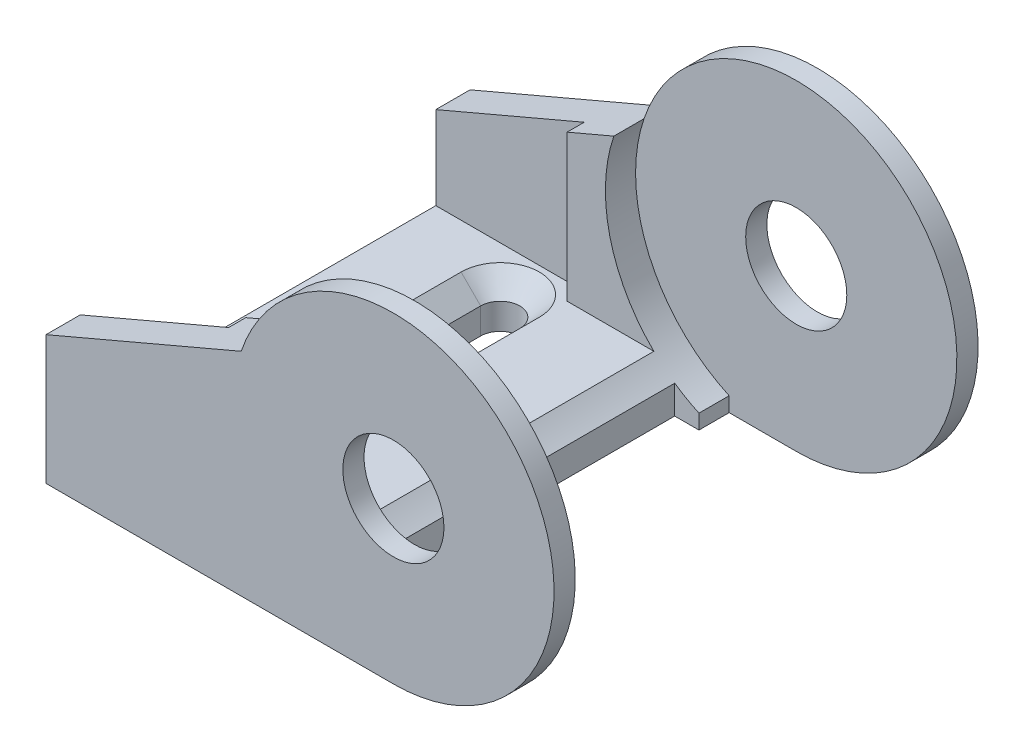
ISO-10303-21;
HEADER;
FILE_DESCRIPTION(('STEP AP214'),'2;1');
FILE_NAME('part.step','',(''),(''),'','','');
FILE_SCHEMA(('AUTOMOTIVE_DESIGN { 1 0 10303 214 1 1 1 1 }'));
ENDSEC;
DATA;
#1=APPLICATION_CONTEXT('core data for automotive mechanical design processes');
#2=APPLICATION_PROTOCOL_DEFINITION('international standard','automotive_design',2000,#1);
#3=PRODUCT_CONTEXT('',#1,'mechanical');
#4=PRODUCT('Part','Part','',(#3));
#5=PRODUCT_RELATED_PRODUCT_CATEGORY('part','',(#4));
#6=PRODUCT_DEFINITION_FORMATION('','',#4);
#7=PRODUCT_DEFINITION_CONTEXT('part definition',#1,'design');
#8=PRODUCT_DEFINITION('design','',#6,#7);
#9=PRODUCT_DEFINITION_SHAPE('','',#8);
#10=(LENGTH_UNIT() NAMED_UNIT(*) SI_UNIT(.MILLI.,.METRE.));
#11=(NAMED_UNIT(*) PLANE_ANGLE_UNIT() SI_UNIT($,.RADIAN.));
#12=(NAMED_UNIT(*) SI_UNIT($,.STERADIAN.) SOLID_ANGLE_UNIT());
#13=UNCERTAINTY_MEASURE_WITH_UNIT(LENGTH_MEASURE(1.E-05),#10,'distance_accuracy_value','');
#14=(GEOMETRIC_REPRESENTATION_CONTEXT(3) GLOBAL_UNCERTAINTY_ASSIGNED_CONTEXT((#13)) GLOBAL_UNIT_ASSIGNED_CONTEXT((#10,
#11,#12)) REPRESENTATION_CONTEXT('',''));
#15=CARTESIAN_POINT('',(0.,0.,0.));
#16=DIRECTION('',(0.,0.,1.));
#17=DIRECTION('',(1.,0.,0.));
#18=AXIS2_PLACEMENT_3D('',#15,#16,#17);
#19=CARTESIAN_POINT('',(-107.188,-17.907,65.4898962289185));
#20=DIRECTION('',(0.,1.,0.));
#21=DIRECTION('',(0.,0.,1.));
#22=AXIS2_PLACEMENT_3D('',#19,#20,#21);
#23=PLANE('',#22);
#24=DIRECTION('',(0.,0.,-1.));
#25=VECTOR('',#24,1.);
#26=CARTESIAN_POINT('',(-107.188,-17.907,20.701));
#27=LINE('',#26,#25);
#28=CARTESIAN_POINT('',(-107.188,-17.907,20.701));
#29=VERTEX_POINT('',#28);
#30=CARTESIAN_POINT('',(-107.188,-17.907,9.27100000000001));
#31=VERTEX_POINT('',#30);
#32=EDGE_CURVE('E373',#29,#31,#27,.T.);
#33=ORIENTED_EDGE('',*,*,#32,.F.);
#34=CARTESIAN_POINT('',(-113.284,-17.907,20.701));
#35=DIRECTION('',(0.,-1.,0.));
#36=DIRECTION('',(0.,0.,1.));
#37=AXIS2_PLACEMENT_3D('',#34,#35,#36);
#38=CIRCLE('',#37,6.09600000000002);
#39=CARTESIAN_POINT('',(-119.38,-17.907,20.701));
#40=VERTEX_POINT('',#39);
#41=EDGE_CURVE('E382',#40,#29,#38,.F.);
#42=ORIENTED_EDGE('',*,*,#41,.F.);
#43=DIRECTION('',(0.,0.,1.));
#44=VECTOR('',#43,1.);
#45=CARTESIAN_POINT('',(-119.38,-17.907,9.27100000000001));
#46=LINE('',#45,#44);
#47=CARTESIAN_POINT('',(-119.38,-17.907,9.27100000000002));
#48=VERTEX_POINT('',#47);
#49=EDGE_CURVE('E387',#48,#40,#46,.T.);
#50=ORIENTED_EDGE('',*,*,#49,.F.);
#51=CARTESIAN_POINT('',(-113.284,-17.907,9.271));
#52=DIRECTION('',(0.,-1.,0.));
#53=DIRECTION('',(0.,0.,1.));
#54=AXIS2_PLACEMENT_3D('',#51,#52,#53);
#55=CIRCLE('',#54,6.09600000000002);
#56=EDGE_CURVE('E391',#31,#48,#55,.F.);
#57=ORIENTED_EDGE('',*,*,#56,.F.);
#58=EDGE_LOOP('',(#33,#42,#50,#57));
#59=FACE_BOUND('',#58,.T.);
#60=DIRECTION('',(0.,0.,-1.));
#61=VECTOR('',#60,1.);
#62=CARTESIAN_POINT('',(-107.188,-17.907,-20.701));
#63=LINE('',#62,#61);
#64=CARTESIAN_POINT('',(-107.188,-17.907,-20.701));
#65=VERTEX_POINT('',#64);
#66=CARTESIAN_POINT('',(-107.188,-17.907,-9.27100000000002));
#67=VERTEX_POINT('',#66);
#68=EDGE_CURVE('E333',#65,#67,#63,.F.);
#69=ORIENTED_EDGE('',*,*,#68,.T.);
#70=CARTESIAN_POINT('',(-113.284,-17.907,-9.271));
#71=DIRECTION('',(0.,-1.,0.));
#72=DIRECTION('',(0.,0.,1.));
#73=AXIS2_PLACEMENT_3D('',#70,#71,#72);
#74=CIRCLE('',#73,6.09600000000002);
#75=CARTESIAN_POINT('',(-119.38,-17.907,-9.27100000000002));
#76=VERTEX_POINT('',#75);
#77=EDGE_CURVE('E329',#67,#76,#74,.T.);
#78=ORIENTED_EDGE('',*,*,#77,.T.);
#79=DIRECTION('',(0.,0.,1.));
#80=VECTOR('',#79,1.);
#81=CARTESIAN_POINT('',(-119.38,-17.907,-9.27100000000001));
#82=LINE('',#81,#80);
#83=CARTESIAN_POINT('',(-119.38,-17.907,-20.701));
#84=VERTEX_POINT('',#83);
#85=EDGE_CURVE('E339',#76,#84,#82,.F.);
#86=ORIENTED_EDGE('',*,*,#85,.T.);
#87=CARTESIAN_POINT('',(-113.284,-17.907,-20.701));
#88=DIRECTION('',(0.,-1.,0.));
#89=DIRECTION('',(0.,0.,1.));
#90=AXIS2_PLACEMENT_3D('',#87,#88,#89);
#91=CIRCLE('',#90,6.09600000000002);
#92=EDGE_CURVE('E336',#84,#65,#91,.T.);
#93=ORIENTED_EDGE('',*,*,#92,.T.);
#94=EDGE_LOOP('',(#69,#78,#86,#93));
#95=FACE_BOUND('',#94,.T.);
#96=DIRECTION('',(-1.,0.,0.));
#97=VECTOR('',#96,1.);
#98=CARTESIAN_POINT('',(-90.424,-17.907,25.019));
#99=LINE('',#98,#97);
#100=CARTESIAN_POINT('',(-93.6725416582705,-17.907,25.019));
#101=VERTEX_POINT('',#100);
#102=CARTESIAN_POINT('',(-107.188,-17.907,25.019));
#103=VERTEX_POINT('',#102);
#104=EDGE_CURVE('E474',#101,#103,#99,.T.);
#105=ORIENTED_EDGE('',*,*,#104,.F.);
#106=DIRECTION('',(0.,0.,-1.));
#107=VECTOR('',#106,1.);
#108=CARTESIAN_POINT('',(-93.6725416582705,-17.907,100.482418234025));
#109=LINE('',#108,#107);
#110=CARTESIAN_POINT('',(-93.6725416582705,-17.907,-25.019));
#111=VERTEX_POINT('',#110);
#112=EDGE_CURVE('E50',#101,#111,#109,.T.);
#113=ORIENTED_EDGE('',*,*,#112,.T.);
#114=DIRECTION('',(-1.,0.,0.));
#115=VECTOR('',#114,1.);
#116=CARTESIAN_POINT('',(-90.424,-17.907,-25.019));
#117=LINE('',#116,#115);
#118=CARTESIAN_POINT('',(-107.188,-17.907,-25.019));
#119=VERTEX_POINT('',#118);
#120=EDGE_CURVE('E464',#111,#119,#117,.T.);
#121=ORIENTED_EDGE('',*,*,#120,.T.);
#122=DIRECTION('',(0.,0.,-1.));
#123=VECTOR('',#122,1.);
#124=CARTESIAN_POINT('',(-107.188,-17.907,65.4898962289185));
#125=LINE('',#124,#123);
#126=CARTESIAN_POINT('',(-107.188,-17.907,-27.686));
#127=VERTEX_POINT('',#126);
#128=EDGE_CURVE('E513',#119,#127,#125,.T.);
#129=ORIENTED_EDGE('',*,*,#128,.T.);
#130=DIRECTION('',(1.,0.,0.));
#131=VECTOR('',#130,1.);
#132=CARTESIAN_POINT('',(-107.188,-17.907,-27.686));
#133=LINE('',#132,#131);
#134=CARTESIAN_POINT('',(-130.302,-17.907,-27.686));
#135=VERTEX_POINT('',#134);
#136=EDGE_CURVE('E486',#135,#127,#133,.T.);
#137=ORIENTED_EDGE('',*,*,#136,.F.);
#138=DIRECTION('',(0.,0.,-1.));
#139=VECTOR('',#138,1.);
#140=CARTESIAN_POINT('',(-130.302,-17.907,65.4898962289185));
#141=LINE('',#140,#139);
#142=CARTESIAN_POINT('',(-130.302,-17.907,27.686));
#143=VERTEX_POINT('',#142);
#144=EDGE_CURVE('E509',#143,#135,#141,.T.);
#145=ORIENTED_EDGE('',*,*,#144,.F.);
#146=DIRECTION('',(-1.,0.,0.));
#147=VECTOR('',#146,1.);
#148=CARTESIAN_POINT('',(-107.188,-17.907,27.686));
#149=LINE('',#148,#147);
#150=CARTESIAN_POINT('',(-107.188,-17.907,27.686));
#151=VERTEX_POINT('',#150);
#152=EDGE_CURVE('E497',#151,#143,#149,.T.);
#153=ORIENTED_EDGE('',*,*,#152,.F.);
#154=EDGE_CURVE('E514',#151,#103,#125,.T.);
#155=ORIENTED_EDGE('',*,*,#154,.T.);
#156=EDGE_LOOP('',(#105,#113,#121,#129,#137,#145,#153,#155));
#157=FACE_BOUND('',#156,.T.);
#158=ADVANCED_FACE('F34',(#59,#95,#157),#23,.T.);
#159=CARTESIAN_POINT('',(-76.2,-25.019,33.02));
#160=DIRECTION('',(0.,1.,0.));
#161=DIRECTION('',(0.,0.,1.));
#162=AXIS2_PLACEMENT_3D('',#159,#160,#161);
#163=PLANE('',#162);
#164=DIRECTION('',(0.,0.,-1.));
#165=VECTOR('',#164,1.);
#166=CARTESIAN_POINT('',(-110.236,-25.019,20.701));
#167=LINE('',#166,#165);
#168=CARTESIAN_POINT('',(-110.236,-25.019,20.701));
#169=VERTEX_POINT('',#168);
#170=CARTESIAN_POINT('',(-110.236,-25.019,9.27100000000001));
#171=VERTEX_POINT('',#170);
#172=EDGE_CURVE('E415',#169,#171,#167,.T.);
#173=ORIENTED_EDGE('',*,*,#172,.T.);
#174=CARTESIAN_POINT('',(-113.284,-25.019,9.271));
#175=DIRECTION('',(0.,1.,0.));
#176=DIRECTION('',(0.,0.,-1.));
#177=AXIS2_PLACEMENT_3D('',#174,#175,#176);
#178=CIRCLE('',#177,3.04800000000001);
#179=CARTESIAN_POINT('',(-116.332,-25.019,9.27100000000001));
#180=VERTEX_POINT('',#179);
#181=EDGE_CURVE('E418',#171,#180,#178,.T.);
#182=ORIENTED_EDGE('',*,*,#181,.T.);
#183=DIRECTION('',(0.,0.,1.));
#184=VECTOR('',#183,1.);
#185=CARTESIAN_POINT('',(-116.332,-25.019,20.701));
#186=LINE('',#185,#184);
#187=CARTESIAN_POINT('',(-116.332,-25.019,20.701));
#188=VERTEX_POINT('',#187);
#189=EDGE_CURVE('E403',#180,#188,#186,.T.);
#190=ORIENTED_EDGE('',*,*,#189,.T.);
#191=CARTESIAN_POINT('',(-113.284,-25.019,20.701));
#192=DIRECTION('',(0.,1.,0.));
#193=DIRECTION('',(0.,0.,-1.));
#194=AXIS2_PLACEMENT_3D('',#191,#192,#193);
#195=CIRCLE('',#194,3.04800000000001);
#196=EDGE_CURVE('E398',#188,#169,#195,.T.);
#197=ORIENTED_EDGE('',*,*,#196,.T.);
#198=EDGE_LOOP('',(#173,#182,#190,#197));
#199=FACE_BOUND('',#198,.T.);
#200=CARTESIAN_POINT('',(-113.284,-25.019,-20.701));
#201=DIRECTION('',(0.,-1.,0.));
#202=DIRECTION('',(0.,0.,1.));
#203=AXIS2_PLACEMENT_3D('',#200,#201,#202);
#204=CIRCLE('',#203,3.04800000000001);
#205=CARTESIAN_POINT('',(-116.332,-25.019,-20.701));
#206=VERTEX_POINT('',#205);
#207=CARTESIAN_POINT('',(-110.236,-25.019,-20.701));
#208=VERTEX_POINT('',#207);
#209=EDGE_CURVE('E332',#206,#208,#204,.T.);
#210=ORIENTED_EDGE('',*,*,#209,.F.);
#211=DIRECTION('',(0.,0.,-1.));
#212=VECTOR('',#211,1.);
#213=CARTESIAN_POINT('',(-116.332,-25.019,-20.701));
#214=LINE('',#213,#212);
#215=CARTESIAN_POINT('',(-116.332,-25.019,-9.27100000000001));
#216=VERTEX_POINT('',#215);
#217=EDGE_CURVE('E363',#216,#206,#214,.T.);
#218=ORIENTED_EDGE('',*,*,#217,.F.);
#219=CARTESIAN_POINT('',(-113.284,-25.019,-9.271));
#220=DIRECTION('',(0.,-1.,0.));
#221=DIRECTION('',(0.,0.,1.));
#222=AXIS2_PLACEMENT_3D('',#219,#220,#221);
#223=CIRCLE('',#222,3.04800000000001);
#224=CARTESIAN_POINT('',(-110.236,-25.019,-9.27100000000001));
#225=VERTEX_POINT('',#224);
#226=EDGE_CURVE('E366',#225,#216,#223,.T.);
#227=ORIENTED_EDGE('',*,*,#226,.F.);
#228=DIRECTION('',(0.,0.,1.));
#229=VECTOR('',#228,1.);
#230=CARTESIAN_POINT('',(-110.236,-25.019,-20.701));
#231=LINE('',#230,#229);
#232=EDGE_CURVE('E352',#208,#225,#231,.T.);
#233=ORIENTED_EDGE('',*,*,#232,.F.);
#234=EDGE_LOOP('',(#210,#218,#227,#233));
#235=FACE_BOUND('',#234,.T.);
#236=DIRECTION('',(0.,0.,-1.));
#237=VECTOR('',#236,1.);
#238=CARTESIAN_POINT('',(-86.6480176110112,-25.019,100.482418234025));
#239=LINE('',#238,#237);
#240=CARTESIAN_POINT('',(-86.6480176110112,-25.019,29.718));
#241=VERTEX_POINT('',#240);
#242=CARTESIAN_POINT('',(-86.6480176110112,-25.019,25.019));
#243=VERTEX_POINT('',#242);
#244=EDGE_CURVE('E278',#241,#243,#239,.T.);
#245=ORIENTED_EDGE('',*,*,#244,.F.);
#246=DIRECTION('',(1.,0.,0.));
#247=VECTOR('',#246,1.);
#248=CARTESIAN_POINT('',(-86.6480176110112,-25.019,29.718));
#249=LINE('',#248,#247);
#250=CARTESIAN_POINT('',(-76.2,-25.019,29.718));
#251=VERTEX_POINT('',#250);
#252=EDGE_CURVE('E299',#241,#251,#249,.T.);
#253=ORIENTED_EDGE('',*,*,#252,.T.);
#254=DIRECTION('',(0.,0.,-1.));
#255=VECTOR('',#254,1.);
#256=CARTESIAN_POINT('',(-76.2,-25.019,33.02));
#257=LINE('',#256,#255);
#258=CARTESIAN_POINT('',(-76.2,-25.019,33.02));
#259=VERTEX_POINT('',#258);
#260=EDGE_CURVE('E549',#259,#251,#257,.T.);
#261=ORIENTED_EDGE('',*,*,#260,.F.);
#262=DIRECTION('',(-1.,0.,0.));
#263=VECTOR('',#262,1.);
#264=CARTESIAN_POINT('',(-76.2,-25.019,33.02));
#265=LINE('',#264,#263);
#266=CARTESIAN_POINT('',(-130.302,-25.019,33.02));
#267=VERTEX_POINT('',#266);
#268=EDGE_CURVE('E519',#259,#267,#265,.T.);
#269=ORIENTED_EDGE('',*,*,#268,.T.);
#270=DIRECTION('',(0.,0.,-1.));
#271=VECTOR('',#270,1.);
#272=CARTESIAN_POINT('',(-130.302,-25.019,33.02));
#273=LINE('',#272,#271);
#274=CARTESIAN_POINT('',(-130.302,-25.019,27.686));
#275=VERTEX_POINT('',#274);
#276=EDGE_CURVE('E546',#267,#275,#273,.T.);
#277=ORIENTED_EDGE('',*,*,#276,.T.);
#278=DIRECTION('',(1.,0.,0.));
#279=VECTOR('',#278,1.);
#280=CARTESIAN_POINT('',(-120.396,-25.019,27.686));
#281=LINE('',#280,#279);
#282=CARTESIAN_POINT('',(-120.396,-25.019,27.686));
#283=VERTEX_POINT('',#282);
#284=EDGE_CURVE('E435',#275,#283,#281,.T.);
#285=ORIENTED_EDGE('',*,*,#284,.T.);
#286=DIRECTION('',(0.,0.,-1.));
#287=VECTOR('',#286,1.);
#288=CARTESIAN_POINT('',(-120.396,-25.019,-27.686));
#289=LINE('',#288,#287);
#290=CARTESIAN_POINT('',(-120.396,-25.019,-27.686));
#291=VERTEX_POINT('',#290);
#292=EDGE_CURVE('E425',#283,#291,#289,.T.);
#293=ORIENTED_EDGE('',*,*,#292,.T.);
#294=DIRECTION('',(-1.,0.,0.));
#295=VECTOR('',#294,1.);
#296=CARTESIAN_POINT('',(-120.396,-25.019,-27.686));
#297=LINE('',#296,#295);
#298=CARTESIAN_POINT('',(-130.302,-25.019,-27.686));
#299=VERTEX_POINT('',#298);
#300=EDGE_CURVE('E445',#291,#299,#297,.T.);
#301=ORIENTED_EDGE('',*,*,#300,.T.);
#302=CARTESIAN_POINT('',(-130.302,-25.019,-33.02));
#303=VERTEX_POINT('',#302);
#304=EDGE_CURVE('E545',#299,#303,#273,.T.);
#305=ORIENTED_EDGE('',*,*,#304,.T.);
#306=DIRECTION('',(-1.,0.,0.));
#307=VECTOR('',#306,1.);
#308=CARTESIAN_POINT('',(-76.2,-25.019,-33.02));
#309=LINE('',#308,#307);
#310=CARTESIAN_POINT('',(-76.2,-25.019,-33.02));
#311=VERTEX_POINT('',#310);
#312=EDGE_CURVE('E500',#311,#303,#309,.T.);
#313=ORIENTED_EDGE('',*,*,#312,.F.);
#314=CARTESIAN_POINT('',(-76.2,-25.019,-29.718));
#315=VERTEX_POINT('',#314);
#316=EDGE_CURVE('E294',#315,#311,#257,.T.);
#317=ORIENTED_EDGE('',*,*,#316,.F.);
#318=DIRECTION('',(1.,0.,0.));
#319=VECTOR('',#318,1.);
#320=CARTESIAN_POINT('',(-86.6480176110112,-25.019,-29.718));
#321=LINE('',#320,#319);
#322=CARTESIAN_POINT('',(-86.6480176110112,-25.019,-29.718));
#323=VERTEX_POINT('',#322);
#324=EDGE_CURVE('E285',#323,#315,#321,.T.);
#325=ORIENTED_EDGE('',*,*,#324,.F.);
#326=CARTESIAN_POINT('',(-86.6480176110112,-25.019,-25.019));
#327=VERTEX_POINT('',#326);
#328=EDGE_CURVE('E268',#327,#323,#239,.T.);
#329=ORIENTED_EDGE('',*,*,#328,.F.);
#330=DIRECTION('',(-1.,0.,0.));
#331=VECTOR('',#330,1.);
#332=CARTESIAN_POINT('',(-76.2,-25.019,-25.019));
#333=LINE('',#332,#331);
#334=CARTESIAN_POINT('',(-90.424,-25.019,-25.019));
#335=VERTEX_POINT('',#334);
#336=EDGE_CURVE('E458',#327,#335,#333,.T.);
#337=ORIENTED_EDGE('',*,*,#336,.T.);
#338=DIRECTION('',(0.,0.,1.));
#339=VECTOR('',#338,1.);
#340=CARTESIAN_POINT('',(-90.424,-25.019,-25.019));
#341=LINE('',#340,#339);
#342=CARTESIAN_POINT('',(-90.424,-25.019,25.019));
#343=VERTEX_POINT('',#342);
#344=EDGE_CURVE('E469',#335,#343,#341,.T.);
#345=ORIENTED_EDGE('',*,*,#344,.T.);
#346=DIRECTION('',(-1.,0.,0.));
#347=VECTOR('',#346,1.);
#348=CARTESIAN_POINT('',(-76.2,-25.019,25.019));
#349=LINE('',#348,#347);
#350=EDGE_CURVE('E452',#243,#343,#349,.T.);
#351=ORIENTED_EDGE('',*,*,#350,.F.);
#352=EDGE_LOOP('',(#245,#253,#261,#269,#277,#285,#293,#301,#305,#313,#317,#325,#329,#337,#345,#351));
#353=FACE_BOUND('',#352,.T.);
#354=ADVANCED_FACE('F292',(#199,#235,#353),#163,.F.);
#355=CARTESIAN_POINT('',(-90.424,-25.019,-25.019));
#356=DIRECTION('',(-1.,0.,0.));
#357=DIRECTION('',(0.,0.,-1.));
#358=AXIS2_PLACEMENT_3D('',#355,#356,#357);
#359=PLANE('',#358);
#360=DIRECTION('',(0.,0.,-1.));
#361=VECTOR('',#360,1.);
#362=CARTESIAN_POINT('',(-90.424,-20.5822298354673,100.482418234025));
#363=LINE('',#362,#361);
#364=CARTESIAN_POINT('',(-90.424,-20.5822298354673,25.019));
#365=VERTEX_POINT('',#364);
#366=CARTESIAN_POINT('',(-90.424,-20.5822298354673,-25.019));
#367=VERTEX_POINT('',#366);
#368=EDGE_CURVE('E316',#365,#367,#363,.T.);
#369=ORIENTED_EDGE('',*,*,#368,.F.);
#370=DIRECTION('',(0.,1.,0.));
#371=VECTOR('',#370,1.);
#372=CARTESIAN_POINT('',(-90.424,-25.019,25.019));
#373=LINE('',#372,#371);
#374=EDGE_CURVE('E471',#343,#365,#373,.T.);
#375=ORIENTED_EDGE('',*,*,#374,.F.);
#376=ORIENTED_EDGE('',*,*,#344,.F.);
#377=DIRECTION('',(0.,1.,0.));
#378=VECTOR('',#377,1.);
#379=CARTESIAN_POINT('',(-90.424,-25.019,-25.019));
#380=LINE('',#379,#378);
#381=EDGE_CURVE('E460',#335,#367,#380,.T.);
#382=ORIENTED_EDGE('',*,*,#381,.T.);
#383=EDGE_LOOP('',(#369,#375,#376,#382));
#384=FACE_BOUND('',#383,.T.);
#385=ADVANCED_FACE('F563',(#384),#359,.F.);
#386=CARTESIAN_POINT('',(-76.2,0.,-25.019));
#387=DIRECTION('',(0.,0.,1.));
#388=DIRECTION('',(-1.,0.,0.));
#389=AXIS2_PLACEMENT_3D('',#386,#387,#388);
#390=PLANE('',#389);
#391=ORIENTED_EDGE('',*,*,#336,.F.);
#392=DIRECTION('',(0.,1.,0.));
#393=VECTOR('',#392,1.);
#394=CARTESIAN_POINT('',(-86.6480176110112,0.,-25.019));
#395=LINE('',#394,#393);
#396=CARTESIAN_POINT('',(-86.6480176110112,-22.733,-25.019));
#397=VERTEX_POINT('',#396);
#398=EDGE_CURVE('E274',#327,#397,#395,.T.);
#399=ORIENTED_EDGE('',*,*,#398,.T.);
#400=CARTESIAN_POINT('',(-76.2,0.,-25.019));
#401=DIRECTION('',(0.,0.,1.));
#402=DIRECTION('',(1.,0.,0.));
#403=AXIS2_PLACEMENT_3D('',#400,#401,#402);
#404=CIRCLE('',#403,25.019);
#405=EDGE_CURVE('E317',#397,#367,#404,.F.);
#406=ORIENTED_EDGE('',*,*,#405,.T.);
#407=ORIENTED_EDGE('',*,*,#381,.F.);
#408=EDGE_LOOP('',(#391,#399,#406,#407));
#409=FACE_BOUND('',#408,.T.);
#410=ADVANCED_FACE('F569',(#409),#390,.T.);
#411=ORIENTED_EDGE('',*,*,#120,.F.);
#412=CARTESIAN_POINT('',(-99.9051547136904,8.001,-25.019));
#413=VERTEX_POINT('',#412);
#414=EDGE_CURVE('E313',#111,#413,#404,.F.);
#415=ORIENTED_EDGE('',*,*,#414,.T.);
#416=DIRECTION('',(0.919945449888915,0.392046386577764,0.));
#417=VECTOR('',#416,1.);
#418=CARTESIAN_POINT('',(-130.302,-4.953,-25.019));
#419=LINE('',#418,#417);
#420=CARTESIAN_POINT('',(-107.188,4.89732338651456,-25.019));
#421=VERTEX_POINT('',#420);
#422=EDGE_CURVE('E466',#421,#413,#419,.T.);
#423=ORIENTED_EDGE('',*,*,#422,.F.);
#424=DIRECTION('',(0.,-1.,0.));
#425=VECTOR('',#424,1.);
#426=CARTESIAN_POINT('',(-107.188,4.89732338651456,-25.019));
#427=LINE('',#426,#425);
#428=EDGE_CURVE('E483',#421,#119,#427,.T.);
#429=ORIENTED_EDGE('',*,*,#428,.T.);
#430=EDGE_LOOP('',(#411,#415,#423,#429));
#431=FACE_BOUND('',#430,.T.);
#432=ADVANCED_FACE('F582',(#431),#390,.T.);
#433=CARTESIAN_POINT('',(-76.2,0.,25.019));
#434=DIRECTION('',(0.,0.,1.));
#435=DIRECTION('',(-1.,0.,0.));
#436=AXIS2_PLACEMENT_3D('',#433,#434,#435);
#437=PLANE('',#436);
#438=DIRECTION('',(0.,1.,0.));
#439=VECTOR('',#438,1.);
#440=CARTESIAN_POINT('',(-86.6480176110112,0.,25.019));
#441=LINE('',#440,#439);
#442=CARTESIAN_POINT('',(-86.6480176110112,-22.733,25.019));
#443=VERTEX_POINT('',#442);
#444=EDGE_CURVE('E12',#243,#443,#441,.T.);
#445=ORIENTED_EDGE('',*,*,#444,.F.);
#446=ORIENTED_EDGE('',*,*,#350,.T.);
#447=ORIENTED_EDGE('',*,*,#374,.T.);
#448=CARTESIAN_POINT('',(-76.2,0.,25.019));
#449=DIRECTION('',(0.,0.,1.));
#450=DIRECTION('',(1.,0.,0.));
#451=AXIS2_PLACEMENT_3D('',#448,#449,#450);
#452=CIRCLE('',#451,25.019);
#453=EDGE_CURVE('E43',#443,#365,#452,.F.);
#454=ORIENTED_EDGE('',*,*,#453,.F.);
#455=EDGE_LOOP('',(#445,#446,#447,#454));
#456=FACE_BOUND('',#455,.T.);
#457=ADVANCED_FACE('F566',(#456),#437,.F.);
#458=CARTESIAN_POINT('',(-99.9051547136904,8.001,25.019));
#459=VERTEX_POINT('',#458);
#460=EDGE_CURVE('E552',#101,#459,#452,.F.);
#461=ORIENTED_EDGE('',*,*,#460,.F.);
#462=ORIENTED_EDGE('',*,*,#104,.T.);
#463=DIRECTION('',(0.,-1.,0.));
#464=VECTOR('',#463,1.);
#465=CARTESIAN_POINT('',(-107.188,4.89732338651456,25.019));
#466=LINE('',#465,#464);
#467=CARTESIAN_POINT('',(-107.188,4.89732338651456,25.019));
#468=VERTEX_POINT('',#467);
#469=EDGE_CURVE('E480',#468,#103,#466,.T.);
#470=ORIENTED_EDGE('',*,*,#469,.F.);
#471=DIRECTION('',(0.919945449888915,0.392046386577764,0.));
#472=VECTOR('',#471,1.);
#473=CARTESIAN_POINT('',(-130.302,-4.953,25.019));
#474=LINE('',#473,#472);
#475=EDGE_CURVE('E461',#468,#459,#474,.T.);
#476=ORIENTED_EDGE('',*,*,#475,.T.);
#477=EDGE_LOOP('',(#461,#462,#470,#476));
#478=FACE_BOUND('',#477,.T.);
#479=ADVANCED_FACE('F591',(#478),#437,.F.);
#480=CARTESIAN_POINT('',(-76.2,0.,33.02));
#481=DIRECTION('',(0.,0.,-1.));
#482=DIRECTION('',(1.,0.,0.));
#483=AXIS2_PLACEMENT_3D('',#480,#481,#482);
#484=CYLINDRICAL_SURFACE('',#483,25.019);
#485=DIRECTION('',(0.,0.,-1.));
#486=VECTOR('',#485,1.);
#487=CARTESIAN_POINT('',(-99.9051547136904,8.001,33.02));
#488=LINE('',#487,#486);
#489=CARTESIAN_POINT('',(-99.9051547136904,8.001,-29.718));
#490=VERTEX_POINT('',#489);
#491=CARTESIAN_POINT('',(-99.9051547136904,8.001,-33.02));
#492=VERTEX_POINT('',#491);
#493=EDGE_CURVE('E529',#490,#492,#488,.T.);
#494=ORIENTED_EDGE('',*,*,#493,.F.);
#495=CARTESIAN_POINT('',(-76.2,0.,-29.718));
#496=DIRECTION('',(0.,0.,-1.));
#497=DIRECTION('',(-1.,0.,0.));
#498=AXIS2_PLACEMENT_3D('',#495,#496,#497);
#499=CIRCLE('',#498,25.019);
#500=EDGE_CURVE('E296',#315,#490,#499,.F.);
#501=ORIENTED_EDGE('',*,*,#500,.F.);
#502=ORIENTED_EDGE('',*,*,#316,.T.);
#503=CARTESIAN_POINT('',(-76.2,0.,-33.02));
#504=DIRECTION('',(0.,0.,1.));
#505=DIRECTION('',(1.,0.,0.));
#506=AXIS2_PLACEMENT_3D('',#503,#504,#505);
#507=CIRCLE('',#506,25.019);
#508=EDGE_CURVE('E322',#311,#492,#507,.T.);
#509=ORIENTED_EDGE('',*,*,#508,.T.);
#510=EDGE_LOOP('',(#494,#501,#502,#509));
#511=FACE_BOUND('',#510,.T.);
#512=ADVANCED_FACE('F573',(#511),#484,.T.);
#513=ORIENTED_EDGE('',*,*,#260,.T.);
#514=CARTESIAN_POINT('',(-76.2,0.,29.718));
#515=DIRECTION('',(0.,0.,1.));
#516=DIRECTION('',(1.,0.,0.));
#517=AXIS2_PLACEMENT_3D('',#514,#515,#516);
#518=CIRCLE('',#517,25.019);
#519=CARTESIAN_POINT('',(-99.9051547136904,8.001,29.718));
#520=VERTEX_POINT('',#519);
#521=EDGE_CURVE('E305',#251,#520,#518,.T.);
#522=ORIENTED_EDGE('',*,*,#521,.T.);
#523=CARTESIAN_POINT('',(-99.9051547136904,8.001,33.02));
#524=VERTEX_POINT('',#523);
#525=EDGE_CURVE('E537',#524,#520,#488,.T.);
#526=ORIENTED_EDGE('',*,*,#525,.F.);
#527=CARTESIAN_POINT('',(-76.2,0.,33.02));
#528=DIRECTION('',(0.,0.,1.));
#529=DIRECTION('',(1.,0.,0.));
#530=AXIS2_PLACEMENT_3D('',#527,#528,#529);
#531=CIRCLE('',#530,25.019);
#532=EDGE_CURVE('E325',#259,#524,#531,.T.);
#533=ORIENTED_EDGE('',*,*,#532,.F.);
#534=EDGE_LOOP('',(#513,#522,#526,#533));
#535=FACE_BOUND('',#534,.T.);
#536=ADVANCED_FACE('F36',(#535),#484,.T.);
#537=CARTESIAN_POINT('',(-130.302,-4.953,33.02));
#538=DIRECTION('',(0.392046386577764,-0.919945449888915,0.));
#539=DIRECTION('',(-0.919945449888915,-0.392046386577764,0.));
#540=AXIS2_PLACEMENT_3D('',#537,#538,#539);
#541=PLANE('',#540);
#542=ORIENTED_EDGE('',*,*,#422,.T.);
#543=EDGE_CURVE('E541',#413,#490,#488,.T.);
#544=ORIENTED_EDGE('',*,*,#543,.T.);
#545=ORIENTED_EDGE('',*,*,#493,.T.);
#546=DIRECTION('',(0.919945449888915,0.392046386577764,0.));
#547=VECTOR('',#546,1.);
#548=CARTESIAN_POINT('',(-130.302,-4.953,-33.02));
#549=LINE('',#548,#547);
#550=CARTESIAN_POINT('',(-130.302,-4.953,-33.02));
#551=VERTEX_POINT('',#550);
#552=EDGE_CURVE('E523',#551,#492,#549,.T.);
#553=ORIENTED_EDGE('',*,*,#552,.F.);
#554=DIRECTION('',(0.,0.,-1.));
#555=VECTOR('',#554,1.);
#556=CARTESIAN_POINT('',(-130.302,-4.953,33.02));
#557=LINE('',#556,#555);
#558=CARTESIAN_POINT('',(-130.302,-4.953,-27.686));
#559=VERTEX_POINT('',#558);
#560=EDGE_CURVE('E540',#559,#551,#557,.T.);
#561=ORIENTED_EDGE('',*,*,#560,.F.);
#562=DIRECTION('',(-0.919945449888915,-0.392046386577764,0.));
#563=VECTOR('',#562,1.);
#564=CARTESIAN_POINT('',(-130.302,-4.953,-27.686));
#565=LINE('',#564,#563);
#566=CARTESIAN_POINT('',(-107.188,4.89732338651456,-27.686));
#567=VERTEX_POINT('',#566);
#568=EDGE_CURVE('E491',#567,#559,#565,.T.);
#569=ORIENTED_EDGE('',*,*,#568,.F.);
#570=DIRECTION('',(0.,0.,-1.));
#571=VECTOR('',#570,1.);
#572=CARTESIAN_POINT('',(-107.188,4.89732338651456,65.4898962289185));
#573=LINE('',#572,#571);
#574=EDGE_CURVE('E496',#421,#567,#573,.T.);
#575=ORIENTED_EDGE('',*,*,#574,.F.);
#576=EDGE_LOOP('',(#542,#544,#545,#553,#561,#569,#575));
#577=FACE_BOUND('',#576,.T.);
#578=ADVANCED_FACE('F577',(#577),#541,.F.);
#579=CARTESIAN_POINT('',(-107.188,4.89732338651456,65.4898962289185));
#580=DIRECTION('',(-1.,0.,0.));
#581=DIRECTION('',(0.,1.,0.));
#582=AXIS2_PLACEMENT_3D('',#579,#580,#581);
#583=PLANE('',#582);
#584=ORIENTED_EDGE('',*,*,#574,.T.);
#585=DIRECTION('',(0.,1.,0.));
#586=VECTOR('',#585,1.);
#587=CARTESIAN_POINT('',(-107.188,4.89732338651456,-27.686));
#588=LINE('',#587,#586);
#589=EDGE_CURVE('E494',#127,#567,#588,.T.);
#590=ORIENTED_EDGE('',*,*,#589,.F.);
#591=ORIENTED_EDGE('',*,*,#128,.F.);
#592=ORIENTED_EDGE('',*,*,#428,.F.);
#593=EDGE_LOOP('',(#584,#590,#591,#592));
#594=FACE_BOUND('',#593,.T.);
#595=ADVANCED_FACE('F638',(#594),#583,.T.);
#596=CARTESIAN_POINT('',(-130.302,-25.019,33.02));
#597=DIRECTION('',(1.,0.,0.));
#598=DIRECTION('',(0.,0.,1.));
#599=AXIS2_PLACEMENT_3D('',#596,#597,#598);
#600=PLANE('',#599);
#601=ORIENTED_EDGE('',*,*,#276,.F.);
#602=DIRECTION('',(0.,1.,0.));
#603=VECTOR('',#602,1.);
#604=CARTESIAN_POINT('',(-130.302,-25.019,33.02));
#605=LINE('',#604,#603);
#606=CARTESIAN_POINT('',(-130.302,-4.953,33.02));
#607=VERTEX_POINT('',#606);
#608=EDGE_CURVE('E522',#267,#607,#605,.T.);
#609=ORIENTED_EDGE('',*,*,#608,.T.);
#610=CARTESIAN_POINT('',(-130.302,-4.953,27.686));
#611=VERTEX_POINT('',#610);
#612=EDGE_CURVE('E542',#607,#611,#557,.T.);
#613=ORIENTED_EDGE('',*,*,#612,.T.);
#614=DIRECTION('',(0.,1.,0.));
#615=VECTOR('',#614,1.);
#616=CARTESIAN_POINT('',(-130.302,-17.907,27.686));
#617=LINE('',#616,#615);
#618=EDGE_CURVE('E506',#143,#611,#617,.T.);
#619=ORIENTED_EDGE('',*,*,#618,.F.);
#620=ORIENTED_EDGE('',*,*,#144,.T.);
#621=DIRECTION('',(0.,-1.,0.));
#622=VECTOR('',#621,1.);
#623=CARTESIAN_POINT('',(-130.302,-17.907,-27.686));
#624=LINE('',#623,#622);
#625=EDGE_CURVE('E489',#559,#135,#624,.T.);
#626=ORIENTED_EDGE('',*,*,#625,.F.);
#627=ORIENTED_EDGE('',*,*,#560,.T.);
#628=DIRECTION('',(0.,1.,0.));
#629=VECTOR('',#628,1.);
#630=CARTESIAN_POINT('',(-130.302,-25.019,-33.02));
#631=LINE('',#630,#629);
#632=EDGE_CURVE('E532',#303,#551,#631,.T.);
#633=ORIENTED_EDGE('',*,*,#632,.F.);
#634=ORIENTED_EDGE('',*,*,#304,.F.);
#635=DIRECTION('',(0.,-1.,0.));
#636=VECTOR('',#635,1.);
#637=CARTESIAN_POINT('',(-130.302,-22.987,-27.686));
#638=LINE('',#637,#636);
#639=CARTESIAN_POINT('',(-130.302,-22.987,-27.686));
#640=VERTEX_POINT('',#639);
#641=EDGE_CURVE('E455',#640,#299,#638,.T.);
#642=ORIENTED_EDGE('',*,*,#641,.F.);
#643=DIRECTION('',(0.,0.,1.));
#644=VECTOR('',#643,1.);
#645=CARTESIAN_POINT('',(-130.302,-22.987,-27.686));
#646=LINE('',#645,#644);
#647=CARTESIAN_POINT('',(-130.302,-22.987,27.686));
#648=VERTEX_POINT('',#647);
#649=EDGE_CURVE('E437',#640,#648,#646,.T.);
#650=ORIENTED_EDGE('',*,*,#649,.T.);
#651=DIRECTION('',(0.,-1.,0.));
#652=VECTOR('',#651,1.);
#653=CARTESIAN_POINT('',(-130.302,-22.987,27.686));
#654=LINE('',#653,#652);
#655=EDGE_CURVE('E453',#648,#275,#654,.T.);
#656=ORIENTED_EDGE('',*,*,#655,.T.);
#657=EDGE_LOOP('',(#601,#609,#613,#619,#620,#626,#627,#633,#634,#642,#650,#656));
#658=FACE_BOUND('',#657,.T.);
#659=ADVANCED_FACE('F647',(#658),#600,.F.);
#660=CARTESIAN_POINT('',(-107.188,4.89732338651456,27.686));
#661=VERTEX_POINT('',#660);
#662=EDGE_CURVE('E510',#661,#468,#573,.T.);
#663=ORIENTED_EDGE('',*,*,#662,.F.);
#664=DIRECTION('',(0.919945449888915,0.392046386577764,0.));
#665=VECTOR('',#664,1.);
#666=CARTESIAN_POINT('',(-130.302,-4.953,27.686));
#667=LINE('',#666,#665);
#668=EDGE_CURVE('E503',#611,#661,#667,.T.);
#669=ORIENTED_EDGE('',*,*,#668,.F.);
#670=ORIENTED_EDGE('',*,*,#612,.F.);
#671=DIRECTION('',(0.919945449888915,0.392046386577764,0.));
#672=VECTOR('',#671,1.);
#673=CARTESIAN_POINT('',(-130.302,-4.953,33.02));
#674=LINE('',#673,#672);
#675=EDGE_CURVE('E526',#607,#524,#674,.T.);
#676=ORIENTED_EDGE('',*,*,#675,.T.);
#677=ORIENTED_EDGE('',*,*,#525,.T.);
#678=DIRECTION('',(0.,0.,-1.));
#679=VECTOR('',#678,1.);
#680=CARTESIAN_POINT('',(-99.9051547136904,8.00099999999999,100.482418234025));
#681=LINE('',#680,#679);
#682=EDGE_CURVE('E319',#459,#520,#681,.F.);
#683=ORIENTED_EDGE('',*,*,#682,.F.);
#684=ORIENTED_EDGE('',*,*,#475,.F.);
#685=EDGE_LOOP('',(#663,#669,#670,#676,#677,#683,#684));
#686=FACE_BOUND('',#685,.T.);
#687=ADVANCED_FACE('F597',(#686),#541,.F.);
#688=CARTESIAN_POINT('',(-76.2,0.,33.02));
#689=DIRECTION('',(0.,0.,1.));
#690=DIRECTION('',(-1.,0.,0.));
#691=AXIS2_PLACEMENT_3D('',#688,#689,#690);
#692=PLANE('',#691);
#693=CARTESIAN_POINT('',(-76.2,0.,33.02));
#694=DIRECTION('',(0.,0.,1.));
#695=DIRECTION('',(1.,0.,0.));
#696=AXIS2_PLACEMENT_3D('',#693,#694,#695);
#697=CIRCLE('',#696,7.874);
#698=CARTESIAN_POINT('',(-68.326,0.,33.02));
#699=VERTEX_POINT('',#698);
#700=EDGE_CURVE('E1073',#699,#699,#697,.T.);
#701=ORIENTED_EDGE('',*,*,#700,.F.);
#702=EDGE_LOOP('',(#701));
#703=FACE_BOUND('',#702,.T.);
#704=ORIENTED_EDGE('',*,*,#532,.T.);
#705=ORIENTED_EDGE('',*,*,#675,.F.);
#706=ORIENTED_EDGE('',*,*,#608,.F.);
#707=ORIENTED_EDGE('',*,*,#268,.F.);
#708=EDGE_LOOP('',(#704,#705,#706,#707));
#709=FACE_BOUND('',#708,.T.);
#710=ADVANCED_FACE('F637',(#703,#709),#692,.T.);
#711=ORIENTED_EDGE('',*,*,#469,.T.);
#712=ORIENTED_EDGE('',*,*,#154,.F.);
#713=DIRECTION('',(0.,-1.,0.));
#714=VECTOR('',#713,1.);
#715=CARTESIAN_POINT('',(-107.188,4.89732338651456,27.686));
#716=LINE('',#715,#714);
#717=EDGE_CURVE('E501',#661,#151,#716,.T.);
#718=ORIENTED_EDGE('',*,*,#717,.F.);
#719=ORIENTED_EDGE('',*,*,#662,.T.);
#720=EDGE_LOOP('',(#711,#712,#718,#719));
#721=FACE_BOUND('',#720,.T.);
#722=ADVANCED_FACE('F594',(#721),#583,.T.);
#723=CARTESIAN_POINT('',(-76.2,0.,27.686));
#724=DIRECTION('',(0.,0.,1.));
#725=DIRECTION('',(-1.,0.,0.));
#726=AXIS2_PLACEMENT_3D('',#723,#724,#725);
#727=PLANE('',#726);
#728=ORIENTED_EDGE('',*,*,#618,.T.);
#729=ORIENTED_EDGE('',*,*,#668,.T.);
#730=ORIENTED_EDGE('',*,*,#717,.T.);
#731=ORIENTED_EDGE('',*,*,#152,.T.);
#732=EDGE_LOOP('',(#728,#729,#730,#731));
#733=FACE_BOUND('',#732,.T.);
#734=ADVANCED_FACE('F636',(#733),#727,.F.);
#735=CARTESIAN_POINT('',(-76.2,0.,-27.686));
#736=DIRECTION('',(0.,0.,1.));
#737=DIRECTION('',(-1.,0.,0.));
#738=AXIS2_PLACEMENT_3D('',#735,#736,#737);
#739=PLANE('',#738);
#740=ORIENTED_EDGE('',*,*,#568,.T.);
#741=ORIENTED_EDGE('',*,*,#625,.T.);
#742=ORIENTED_EDGE('',*,*,#136,.T.);
#743=ORIENTED_EDGE('',*,*,#589,.T.);
#744=EDGE_LOOP('',(#740,#741,#742,#743));
#745=FACE_BOUND('',#744,.T.);
#746=ADVANCED_FACE('F632',(#745),#739,.T.);
#747=CARTESIAN_POINT('',(-120.396,-22.987,-27.686));
#748=DIRECTION('',(1.,0.,0.));
#749=DIRECTION('',(0.,0.,1.));
#750=AXIS2_PLACEMENT_3D('',#747,#748,#749);
#751=PLANE('',#750);
#752=ORIENTED_EDGE('',*,*,#292,.F.);
#753=DIRECTION('',(0.,-1.,0.));
#754=VECTOR('',#753,1.);
#755=CARTESIAN_POINT('',(-120.396,-22.987,27.686));
#756=LINE('',#755,#754);
#757=CARTESIAN_POINT('',(-120.396,-22.987,27.686));
#758=VERTEX_POINT('',#757);
#759=EDGE_CURVE('E450',#758,#283,#756,.T.);
#760=ORIENTED_EDGE('',*,*,#759,.F.);
#761=DIRECTION('',(0.,0.,-1.));
#762=VECTOR('',#761,1.);
#763=CARTESIAN_POINT('',(-120.396,-22.987,-27.686));
#764=LINE('',#763,#762);
#765=CARTESIAN_POINT('',(-120.396,-22.987,-27.686));
#766=VERTEX_POINT('',#765);
#767=EDGE_CURVE('E431',#758,#766,#764,.T.);
#768=ORIENTED_EDGE('',*,*,#767,.T.);
#769=DIRECTION('',(0.,-1.,0.));
#770=VECTOR('',#769,1.);
#771=CARTESIAN_POINT('',(-120.396,-22.987,-27.686));
#772=LINE('',#771,#770);
#773=EDGE_CURVE('E442',#766,#291,#772,.T.);
#774=ORIENTED_EDGE('',*,*,#773,.T.);
#775=EDGE_LOOP('',(#752,#760,#768,#774));
#776=FACE_BOUND('',#775,.T.);
#777=ADVANCED_FACE('F663',(#776),#751,.F.);
#778=CARTESIAN_POINT('',(-120.396,-22.987,27.686));
#779=DIRECTION('',(0.,0.,1.));
#780=DIRECTION('',(-1.,0.,0.));
#781=AXIS2_PLACEMENT_3D('',#778,#779,#780);
#782=PLANE('',#781);
#783=ORIENTED_EDGE('',*,*,#284,.F.);
#784=ORIENTED_EDGE('',*,*,#655,.F.);
#785=DIRECTION('',(1.,0.,0.));
#786=VECTOR('',#785,1.);
#787=CARTESIAN_POINT('',(-120.396,-22.987,27.686));
#788=LINE('',#787,#786);
#789=EDGE_CURVE('E440',#648,#758,#788,.T.);
#790=ORIENTED_EDGE('',*,*,#789,.T.);
#791=ORIENTED_EDGE('',*,*,#759,.T.);
#792=EDGE_LOOP('',(#783,#784,#790,#791));
#793=FACE_BOUND('',#792,.T.);
#794=ADVANCED_FACE('F659',(#793),#782,.F.);
#795=CARTESIAN_POINT('',(-120.396,-22.987,-27.686));
#796=DIRECTION('',(0.,0.,-1.));
#797=DIRECTION('',(1.,0.,0.));
#798=AXIS2_PLACEMENT_3D('',#795,#796,#797);
#799=PLANE('',#798);
#800=ORIENTED_EDGE('',*,*,#300,.F.);
#801=ORIENTED_EDGE('',*,*,#773,.F.);
#802=DIRECTION('',(-1.,0.,0.));
#803=VECTOR('',#802,1.);
#804=CARTESIAN_POINT('',(-120.396,-22.987,-27.686));
#805=LINE('',#804,#803);
#806=EDGE_CURVE('E434',#766,#640,#805,.T.);
#807=ORIENTED_EDGE('',*,*,#806,.T.);
#808=ORIENTED_EDGE('',*,*,#641,.T.);
#809=EDGE_LOOP('',(#800,#801,#807,#808));
#810=FACE_BOUND('',#809,.T.);
#811=ADVANCED_FACE('F667',(#810),#799,.F.);
#812=CARTESIAN_POINT('',(-120.396,-22.987,27.686));
#813=DIRECTION('',(0.,1.,0.));
#814=DIRECTION('',(0.,0.,1.));
#815=AXIS2_PLACEMENT_3D('',#812,#813,#814);
#816=PLANE('',#815);
#817=ORIENTED_EDGE('',*,*,#767,.F.);
#818=ORIENTED_EDGE('',*,*,#789,.F.);
#819=ORIENTED_EDGE('',*,*,#649,.F.);
#820=ORIENTED_EDGE('',*,*,#806,.F.);
#821=EDGE_LOOP('',(#817,#818,#819,#820));
#822=FACE_BOUND('',#821,.T.);
#823=ADVANCED_FACE('F776',(#822),#816,.F.);
#824=CARTESIAN_POINT('',(-113.284,-20.955,20.701));
#825=DIRECTION('',(0.,-1.,0.));
#826=DIRECTION('',(0.,0.,-1.));
#827=AXIS2_PLACEMENT_3D('',#824,#825,#826);
#828=CYLINDRICAL_SURFACE('',#827,3.04800000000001);
#829=ORIENTED_EDGE('',*,*,#196,.F.);
#830=DIRECTION('',(0.,-1.,0.));
#831=VECTOR('',#830,1.);
#832=CARTESIAN_POINT('',(-116.332,-20.955,20.701));
#833=LINE('',#832,#831);
#834=CARTESIAN_POINT('',(-116.332,-20.955,20.701));
#835=VERTEX_POINT('',#834);
#836=EDGE_CURVE('E423',#835,#188,#833,.T.);
#837=ORIENTED_EDGE('',*,*,#836,.F.);
#838=CARTESIAN_POINT('',(-113.284,-20.955,20.701));
#839=DIRECTION('',(0.,1.,0.));
#840=DIRECTION('',(0.,0.,-1.));
#841=AXIS2_PLACEMENT_3D('',#838,#839,#840);
#842=CIRCLE('',#841,3.04800000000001);
#843=CARTESIAN_POINT('',(-110.236,-20.955,20.701));
#844=VERTEX_POINT('',#843);
#845=EDGE_CURVE('E399',#835,#844,#842,.T.);
#846=ORIENTED_EDGE('',*,*,#845,.T.);
#847=DIRECTION('',(0.,-1.,0.));
#848=VECTOR('',#847,1.);
#849=CARTESIAN_POINT('',(-110.236,-20.955,20.701));
#850=LINE('',#849,#848);
#851=EDGE_CURVE('E412',#844,#169,#850,.T.);
#852=ORIENTED_EDGE('',*,*,#851,.T.);
#853=EDGE_LOOP('',(#829,#837,#846,#852));
#854=FACE_BOUND('',#853,.T.);
#855=ADVANCED_FACE('F784',(#854),#828,.F.);
#856=CARTESIAN_POINT('',(-116.332,-20.955,20.701));
#857=DIRECTION('',(-1.,0.,0.));
#858=DIRECTION('',(0.,0.,-1.));
#859=AXIS2_PLACEMENT_3D('',#856,#857,#858);
#860=PLANE('',#859);
#861=ORIENTED_EDGE('',*,*,#189,.F.);
#862=DIRECTION('',(0.,-1.,0.));
#863=VECTOR('',#862,1.);
#864=CARTESIAN_POINT('',(-116.332,-20.955,9.27100000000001));
#865=LINE('',#864,#863);
#866=CARTESIAN_POINT('',(-116.332,-20.955,9.27100000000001));
#867=VERTEX_POINT('',#866);
#868=EDGE_CURVE('E426',#867,#180,#865,.T.);
#869=ORIENTED_EDGE('',*,*,#868,.F.);
#870=DIRECTION('',(0.,0.,1.));
#871=VECTOR('',#870,1.);
#872=CARTESIAN_POINT('',(-116.332,-20.955,20.701));
#873=LINE('',#872,#871);
#874=EDGE_CURVE('E409',#867,#835,#873,.T.);
#875=ORIENTED_EDGE('',*,*,#874,.T.);
#876=ORIENTED_EDGE('',*,*,#836,.T.);
#877=EDGE_LOOP('',(#861,#869,#875,#876));
#878=FACE_BOUND('',#877,.T.);
#879=ADVANCED_FACE('F794',(#878),#860,.F.);
#880=CARTESIAN_POINT('',(-113.284,-20.955,9.271));
#881=DIRECTION('',(0.,-1.,0.));
#882=DIRECTION('',(0.,0.,-1.));
#883=AXIS2_PLACEMENT_3D('',#880,#881,#882);
#884=CYLINDRICAL_SURFACE('',#883,3.04800000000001);
#885=ORIENTED_EDGE('',*,*,#181,.F.);
#886=DIRECTION('',(0.,-1.,0.));
#887=VECTOR('',#886,1.);
#888=CARTESIAN_POINT('',(-110.236,-20.955,9.27100000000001));
#889=LINE('',#888,#887);
#890=CARTESIAN_POINT('',(-110.236,-20.955,9.27100000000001));
#891=VERTEX_POINT('',#890);
#892=EDGE_CURVE('E428',#891,#171,#889,.T.);
#893=ORIENTED_EDGE('',*,*,#892,.F.);
#894=CARTESIAN_POINT('',(-113.284,-20.955,9.271));
#895=DIRECTION('',(0.,1.,0.));
#896=DIRECTION('',(0.,0.,-1.));
#897=AXIS2_PLACEMENT_3D('',#894,#895,#896);
#898=CIRCLE('',#897,3.04800000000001);
#899=EDGE_CURVE('E406',#891,#867,#898,.T.);
#900=ORIENTED_EDGE('',*,*,#899,.T.);
#901=ORIENTED_EDGE('',*,*,#868,.T.);
#902=EDGE_LOOP('',(#885,#893,#900,#901));
#903=FACE_BOUND('',#902,.T.);
#904=ADVANCED_FACE('F804',(#903),#884,.F.);
#905=CARTESIAN_POINT('',(-110.236,-20.955,20.701));
#906=DIRECTION('',(1.,0.,0.));
#907=DIRECTION('',(0.,0.,1.));
#908=AXIS2_PLACEMENT_3D('',#905,#906,#907);
#909=PLANE('',#908);
#910=ORIENTED_EDGE('',*,*,#172,.F.);
#911=ORIENTED_EDGE('',*,*,#851,.F.);
#912=DIRECTION('',(0.,0.,-1.));
#913=VECTOR('',#912,1.);
#914=CARTESIAN_POINT('',(-110.236,-20.955,20.701));
#915=LINE('',#914,#913);
#916=EDGE_CURVE('E402',#844,#891,#915,.T.);
#917=ORIENTED_EDGE('',*,*,#916,.T.);
#918=ORIENTED_EDGE('',*,*,#892,.T.);
#919=EDGE_LOOP('',(#910,#911,#917,#918));
#920=FACE_BOUND('',#919,.T.);
#921=ADVANCED_FACE('F814',(#920),#909,.F.);
#922=CARTESIAN_POINT('',(-110.236,-20.955,20.701));
#923=DIRECTION('',(0.707106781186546,-0.707106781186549,0.));
#924=DIRECTION('',(-0.707106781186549,-0.707106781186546,0.));
#925=AXIS2_PLACEMENT_3D('',#922,#923,#924);
#926=PLANE('',#925);
#927=DIRECTION('',(0.707106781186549,0.707106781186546,0.));
#928=VECTOR('',#927,1.);
#929=CARTESIAN_POINT('',(-110.236,-20.955,20.701));
#930=LINE('',#929,#928);
#931=EDGE_CURVE('E385',#29,#844,#930,.F.);
#932=ORIENTED_EDGE('',*,*,#931,.F.);
#933=ORIENTED_EDGE('',*,*,#32,.T.);
#934=DIRECTION('',(0.707106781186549,0.707106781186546,0.));
#935=VECTOR('',#934,1.);
#936=CARTESIAN_POINT('',(-110.236,-20.955,9.27100000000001));
#937=LINE('',#936,#935);
#938=EDGE_CURVE('E381',#31,#891,#937,.F.);
#939=ORIENTED_EDGE('',*,*,#938,.T.);
#940=ORIENTED_EDGE('',*,*,#916,.F.);
#941=EDGE_LOOP('',(#932,#933,#939,#940));
#942=FACE_BOUND('',#941,.T.);
#943=ADVANCED_FACE('F824',(#942),#926,.F.);
#944=CARTESIAN_POINT('',(-113.284,-20.955,9.271));
#945=DIRECTION('',(0.,1.,0.));
#946=DIRECTION('',(0.,0.,-1.));
#947=AXIS2_PLACEMENT_3D('',#944,#945,#946);
#948=CONICAL_SURFACE('',#947,3.04800000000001,0.78539816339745);
#949=ORIENTED_EDGE('',*,*,#938,.F.);
#950=ORIENTED_EDGE('',*,*,#56,.T.);
#951=DIRECTION('',(-0.707106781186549,0.707106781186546,0.));
#952=VECTOR('',#951,1.);
#953=CARTESIAN_POINT('',(-116.332,-20.955,9.27100000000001));
#954=LINE('',#953,#952);
#955=EDGE_CURVE('E390',#48,#867,#954,.F.);
#956=ORIENTED_EDGE('',*,*,#955,.T.);
#957=ORIENTED_EDGE('',*,*,#899,.F.);
#958=EDGE_LOOP('',(#949,#950,#956,#957));
#959=FACE_BOUND('',#958,.T.);
#960=ADVANCED_FACE('F834',(#959),#948,.F.);
#961=CARTESIAN_POINT('',(-116.332,-20.955,9.27100000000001));
#962=DIRECTION('',(-0.707106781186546,-0.707106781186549,0.));
#963=DIRECTION('',(-0.707106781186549,0.707106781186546,0.));
#964=AXIS2_PLACEMENT_3D('',#961,#962,#963);
#965=PLANE('',#964);
#966=ORIENTED_EDGE('',*,*,#955,.F.);
#967=ORIENTED_EDGE('',*,*,#49,.T.);
#968=DIRECTION('',(-0.707106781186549,0.707106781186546,0.));
#969=VECTOR('',#968,1.);
#970=CARTESIAN_POINT('',(-116.332,-20.955,20.701));
#971=LINE('',#970,#969);
#972=EDGE_CURVE('E386',#40,#835,#971,.F.);
#973=ORIENTED_EDGE('',*,*,#972,.T.);
#974=ORIENTED_EDGE('',*,*,#874,.F.);
#975=EDGE_LOOP('',(#966,#967,#973,#974));
#976=FACE_BOUND('',#975,.T.);
#977=ADVANCED_FACE('F844',(#976),#965,.F.);
#978=CARTESIAN_POINT('',(-113.284,-20.955,20.701));
#979=DIRECTION('',(0.,1.,0.));
#980=DIRECTION('',(0.,0.,-1.));
#981=AXIS2_PLACEMENT_3D('',#978,#979,#980);
#982=CONICAL_SURFACE('',#981,3.04800000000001,0.78539816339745);
#983=ORIENTED_EDGE('',*,*,#972,.F.);
#984=ORIENTED_EDGE('',*,*,#41,.T.);
#985=ORIENTED_EDGE('',*,*,#931,.T.);
#986=ORIENTED_EDGE('',*,*,#845,.F.);
#987=EDGE_LOOP('',(#983,#984,#985,#986));
#988=FACE_BOUND('',#987,.T.);
#989=ADVANCED_FACE('F854',(#988),#982,.F.);
#990=CARTESIAN_POINT('',(-113.284,-20.955,-20.701));
#991=DIRECTION('',(0.,-1.,0.));
#992=DIRECTION('',(0.,0.,-1.));
#993=AXIS2_PLACEMENT_3D('',#990,#991,#992);
#994=CYLINDRICAL_SURFACE('',#993,3.04800000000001);
#995=ORIENTED_EDGE('',*,*,#209,.T.);
#996=DIRECTION('',(0.,-1.,0.));
#997=VECTOR('',#996,1.);
#998=CARTESIAN_POINT('',(-110.236,-20.955,-20.701));
#999=LINE('',#998,#997);
#1000=CARTESIAN_POINT('',(-110.236,-20.955,-20.701));
#1001=VERTEX_POINT('',#1000);
#1002=EDGE_CURVE('E371',#1001,#208,#999,.T.);
#1003=ORIENTED_EDGE('',*,*,#1002,.F.);
#1004=CARTESIAN_POINT('',(-113.284,-20.955,-20.701));
#1005=DIRECTION('',(0.,-1.,0.));
#1006=DIRECTION('',(0.,0.,1.));
#1007=AXIS2_PLACEMENT_3D('',#1004,#1005,#1006);
#1008=CIRCLE('',#1007,3.04800000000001);
#1009=CARTESIAN_POINT('',(-116.332,-20.955,-20.701));
#1010=VERTEX_POINT('',#1009);
#1011=EDGE_CURVE('E348',#1010,#1001,#1008,.T.);
#1012=ORIENTED_EDGE('',*,*,#1011,.F.);
#1013=DIRECTION('',(0.,-1.,0.));
#1014=VECTOR('',#1013,1.);
#1015=CARTESIAN_POINT('',(-116.332,-20.955,-20.701));
#1016=LINE('',#1015,#1014);
#1017=EDGE_CURVE('E360',#1010,#206,#1016,.T.);
#1018=ORIENTED_EDGE('',*,*,#1017,.T.);
#1019=EDGE_LOOP('',(#995,#1003,#1012,#1018));
#1020=FACE_BOUND('',#1019,.T.);
#1021=ADVANCED_FACE('F864',(#1020),#994,.F.);
#1022=CARTESIAN_POINT('',(-110.236,-20.955,-20.701));
#1023=DIRECTION('',(-1.,0.,0.));
#1024=DIRECTION('',(0.,0.,-1.));
#1025=AXIS2_PLACEMENT_3D('',#1022,#1023,#1024);
#1026=PLANE('',#1025);
#1027=ORIENTED_EDGE('',*,*,#232,.T.);
#1028=DIRECTION('',(0.,-1.,0.));
#1029=VECTOR('',#1028,1.);
#1030=CARTESIAN_POINT('',(-110.236,-20.955,-9.27100000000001));
#1031=LINE('',#1030,#1029);
#1032=CARTESIAN_POINT('',(-110.236,-20.955,-9.27100000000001));
#1033=VERTEX_POINT('',#1032);
#1034=EDGE_CURVE('E374',#1033,#225,#1031,.T.);
#1035=ORIENTED_EDGE('',*,*,#1034,.F.);
#1036=DIRECTION('',(0.,0.,1.));
#1037=VECTOR('',#1036,1.);
#1038=CARTESIAN_POINT('',(-110.236,-20.955,-20.701));
#1039=LINE('',#1038,#1037);
#1040=EDGE_CURVE('E357',#1001,#1033,#1039,.T.);
#1041=ORIENTED_EDGE('',*,*,#1040,.F.);
#1042=ORIENTED_EDGE('',*,*,#1002,.T.);
#1043=EDGE_LOOP('',(#1027,#1035,#1041,#1042));
#1044=FACE_BOUND('',#1043,.T.);
#1045=ADVANCED_FACE('F875',(#1044),#1026,.T.);
#1046=CARTESIAN_POINT('',(-113.284,-20.955,-9.271));
#1047=DIRECTION('',(0.,-1.,0.));
#1048=DIRECTION('',(0.,0.,-1.));
#1049=AXIS2_PLACEMENT_3D('',#1046,#1047,#1048);
#1050=CYLINDRICAL_SURFACE('',#1049,3.04800000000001);
#1051=ORIENTED_EDGE('',*,*,#226,.T.);
#1052=DIRECTION('',(0.,-1.,0.));
#1053=VECTOR('',#1052,1.);
#1054=CARTESIAN_POINT('',(-116.332,-20.955,-9.27100000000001));
#1055=LINE('',#1054,#1053);
#1056=CARTESIAN_POINT('',(-116.332,-20.955,-9.27100000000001));
#1057=VERTEX_POINT('',#1056);
#1058=EDGE_CURVE('E376',#1057,#216,#1055,.T.);
#1059=ORIENTED_EDGE('',*,*,#1058,.F.);
#1060=CARTESIAN_POINT('',(-113.284,-20.955,-9.271));
#1061=DIRECTION('',(0.,-1.,0.));
#1062=DIRECTION('',(0.,0.,1.));
#1063=AXIS2_PLACEMENT_3D('',#1060,#1061,#1062);
#1064=CIRCLE('',#1063,3.04800000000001);
#1065=EDGE_CURVE('E355',#1033,#1057,#1064,.T.);
#1066=ORIENTED_EDGE('',*,*,#1065,.F.);
#1067=ORIENTED_EDGE('',*,*,#1034,.T.);
#1068=EDGE_LOOP('',(#1051,#1059,#1066,#1067));
#1069=FACE_BOUND('',#1068,.T.);
#1070=ADVANCED_FACE('F885',(#1069),#1050,.F.);
#1071=CARTESIAN_POINT('',(-116.332,-20.955,-20.701));
#1072=DIRECTION('',(1.,0.,0.));
#1073=DIRECTION('',(0.,0.,1.));
#1074=AXIS2_PLACEMENT_3D('',#1071,#1072,#1073);
#1075=PLANE('',#1074);
#1076=ORIENTED_EDGE('',*,*,#217,.T.);
#1077=ORIENTED_EDGE('',*,*,#1017,.F.);
#1078=DIRECTION('',(0.,0.,-1.));
#1079=VECTOR('',#1078,1.);
#1080=CARTESIAN_POINT('',(-116.332,-20.955,-20.701));
#1081=LINE('',#1080,#1079);
#1082=EDGE_CURVE('E351',#1057,#1010,#1081,.T.);
#1083=ORIENTED_EDGE('',*,*,#1082,.F.);
#1084=ORIENTED_EDGE('',*,*,#1058,.T.);
#1085=EDGE_LOOP('',(#1076,#1077,#1083,#1084));
#1086=FACE_BOUND('',#1085,.T.);
#1087=ADVANCED_FACE('F895',(#1086),#1075,.T.);
#1088=CARTESIAN_POINT('',(-113.284,-20.955,-20.701));
#1089=DIRECTION('',(0.,1.,0.));
#1090=DIRECTION('',(0.,0.,1.));
#1091=AXIS2_PLACEMENT_3D('',#1088,#1089,#1090);
#1092=CONICAL_SURFACE('',#1091,3.04800000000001,0.78539816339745);
#1093=ORIENTED_EDGE('',*,*,#92,.F.);
#1094=DIRECTION('',(-0.707106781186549,0.707106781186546,0.));
#1095=VECTOR('',#1094,1.);
#1096=CARTESIAN_POINT('',(-116.332,-20.955,-20.701));
#1097=LINE('',#1096,#1095);
#1098=EDGE_CURVE('E328',#84,#1010,#1097,.F.);
#1099=ORIENTED_EDGE('',*,*,#1098,.T.);
#1100=ORIENTED_EDGE('',*,*,#1011,.T.);
#1101=DIRECTION('',(0.707106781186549,0.707106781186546,0.));
#1102=VECTOR('',#1101,1.);
#1103=CARTESIAN_POINT('',(-110.236,-20.955,-20.701));
#1104=LINE('',#1103,#1102);
#1105=EDGE_CURVE('E342',#65,#1001,#1104,.F.);
#1106=ORIENTED_EDGE('',*,*,#1105,.F.);
#1107=EDGE_LOOP('',(#1093,#1099,#1100,#1106));
#1108=FACE_BOUND('',#1107,.T.);
#1109=ADVANCED_FACE('F905',(#1108),#1092,.F.);
#1110=CARTESIAN_POINT('',(-110.236,-20.955,-20.701));
#1111=DIRECTION('',(0.707106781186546,-0.707106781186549,0.));
#1112=DIRECTION('',(-0.707106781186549,-0.707106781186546,0.));
#1113=AXIS2_PLACEMENT_3D('',#1110,#1111,#1112);
#1114=PLANE('',#1113);
#1115=ORIENTED_EDGE('',*,*,#68,.F.);
#1116=ORIENTED_EDGE('',*,*,#1105,.T.);
#1117=ORIENTED_EDGE('',*,*,#1040,.T.);
#1118=DIRECTION('',(0.707106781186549,0.707106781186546,0.));
#1119=VECTOR('',#1118,1.);
#1120=CARTESIAN_POINT('',(-110.236,-20.955,-9.27100000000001));
#1121=LINE('',#1120,#1119);
#1122=EDGE_CURVE('E344',#67,#1033,#1121,.F.);
#1123=ORIENTED_EDGE('',*,*,#1122,.F.);
#1124=EDGE_LOOP('',(#1115,#1116,#1117,#1123));
#1125=FACE_BOUND('',#1124,.T.);
#1126=ADVANCED_FACE('F915',(#1125),#1114,.F.);
#1127=CARTESIAN_POINT('',(-113.284,-20.955,-9.271));
#1128=DIRECTION('',(0.,1.,0.));
#1129=DIRECTION('',(0.,0.,1.));
#1130=AXIS2_PLACEMENT_3D('',#1127,#1128,#1129);
#1131=CONICAL_SURFACE('',#1130,3.04800000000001,0.78539816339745);
#1132=ORIENTED_EDGE('',*,*,#77,.F.);
#1133=ORIENTED_EDGE('',*,*,#1122,.T.);
#1134=ORIENTED_EDGE('',*,*,#1065,.T.);
#1135=DIRECTION('',(-0.707106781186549,0.707106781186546,0.));
#1136=VECTOR('',#1135,1.);
#1137=CARTESIAN_POINT('',(-116.332,-20.955,-9.27100000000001));
#1138=LINE('',#1137,#1136);
#1139=EDGE_CURVE('E58',#76,#1057,#1138,.F.);
#1140=ORIENTED_EDGE('',*,*,#1139,.F.);
#1141=EDGE_LOOP('',(#1132,#1133,#1134,#1140));
#1142=FACE_BOUND('',#1141,.T.);
#1143=ADVANCED_FACE('F925',(#1142),#1131,.F.);
#1144=CARTESIAN_POINT('',(-116.332,-20.955,-9.27100000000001));
#1145=DIRECTION('',(-0.707106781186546,-0.707106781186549,0.));
#1146=DIRECTION('',(-0.707106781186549,0.707106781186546,0.));
#1147=AXIS2_PLACEMENT_3D('',#1144,#1145,#1146);
#1148=PLANE('',#1147);
#1149=ORIENTED_EDGE('',*,*,#85,.F.);
#1150=ORIENTED_EDGE('',*,*,#1139,.T.);
#1151=ORIENTED_EDGE('',*,*,#1082,.T.);
#1152=ORIENTED_EDGE('',*,*,#1098,.F.);
#1153=EDGE_LOOP('',(#1149,#1150,#1151,#1152));
#1154=FACE_BOUND('',#1153,.T.);
#1155=ADVANCED_FACE('F616',(#1154),#1148,.F.);
#1156=CARTESIAN_POINT('',(-76.2,0.,-33.02));
#1157=DIRECTION('',(0.,0.,1.));
#1158=DIRECTION('',(-1.,0.,0.));
#1159=AXIS2_PLACEMENT_3D('',#1156,#1157,#1158);
#1160=PLANE('',#1159);
#1161=CARTESIAN_POINT('',(-76.2,0.,-33.02));
#1162=DIRECTION('',(0.,0.,1.));
#1163=DIRECTION('',(1.,0.,0.));
#1164=AXIS2_PLACEMENT_3D('',#1161,#1162,#1163);
#1165=CIRCLE('',#1164,7.874);
#1166=CARTESIAN_POINT('',(-68.326,0.,-33.02));
#1167=VERTEX_POINT('',#1166);
#1168=EDGE_CURVE('E1078',#1167,#1167,#1165,.T.);
#1169=ORIENTED_EDGE('',*,*,#1168,.T.);
#1170=EDGE_LOOP('',(#1169));
#1171=FACE_BOUND('',#1170,.T.);
#1172=ORIENTED_EDGE('',*,*,#552,.T.);
#1173=ORIENTED_EDGE('',*,*,#508,.F.);
#1174=ORIENTED_EDGE('',*,*,#312,.T.);
#1175=ORIENTED_EDGE('',*,*,#632,.T.);
#1176=EDGE_LOOP('',(#1172,#1173,#1174,#1175));
#1177=FACE_BOUND('',#1176,.T.);
#1178=ADVANCED_FACE('F609',(#1171,#1177),#1160,.F.);
#1179=CARTESIAN_POINT('',(-86.6480176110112,-22.733,100.482418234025));
#1180=DIRECTION('',(1.,0.,0.));
#1181=DIRECTION('',(0.,0.,-1.));
#1182=AXIS2_PLACEMENT_3D('',#1179,#1180,#1181);
#1183=PLANE('',#1182);
#1184=ORIENTED_EDGE('',*,*,#444,.T.);
#1185=DIRECTION('',(0.,0.,-1.));
#1186=VECTOR('',#1185,1.);
#1187=CARTESIAN_POINT('',(-86.6480176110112,-22.733,100.482418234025));
#1188=LINE('',#1187,#1186);
#1189=CARTESIAN_POINT('',(-86.6480176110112,-22.733,29.718));
#1190=VERTEX_POINT('',#1189);
#1191=EDGE_CURVE('E279',#1190,#443,#1188,.T.);
#1192=ORIENTED_EDGE('',*,*,#1191,.F.);
#1193=DIRECTION('',(0.,-1.,0.));
#1194=VECTOR('',#1193,1.);
#1195=CARTESIAN_POINT('',(-86.6480176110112,-22.733,29.718));
#1196=LINE('',#1195,#1194);
#1197=EDGE_CURVE('E302',#1190,#241,#1196,.T.);
#1198=ORIENTED_EDGE('',*,*,#1197,.T.);
#1199=ORIENTED_EDGE('',*,*,#244,.T.);
#1200=EDGE_LOOP('',(#1184,#1192,#1198,#1199));
#1201=FACE_BOUND('',#1200,.T.);
#1202=ADVANCED_FACE('F607',(#1201),#1183,.T.);
#1203=CARTESIAN_POINT('',(-76.2,0.,100.482418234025));
#1204=DIRECTION('',(0.,0.,-1.));
#1205=DIRECTION('',(-1.,0.,0.));
#1206=AXIS2_PLACEMENT_3D('',#1203,#1204,#1205);
#1207=CYLINDRICAL_SURFACE('',#1206,25.019);
#1208=ORIENTED_EDGE('',*,*,#682,.T.);
#1209=EDGE_CURVE('E308',#520,#1190,#518,.T.);
#1210=ORIENTED_EDGE('',*,*,#1209,.T.);
#1211=ORIENTED_EDGE('',*,*,#1191,.T.);
#1212=ORIENTED_EDGE('',*,*,#453,.T.);
#1213=ORIENTED_EDGE('',*,*,#368,.T.);
#1214=ORIENTED_EDGE('',*,*,#405,.F.);
#1215=CARTESIAN_POINT('',(-86.6480176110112,-22.733,-29.718));
#1216=VERTEX_POINT('',#1215);
#1217=EDGE_CURVE('E310',#397,#1216,#1188,.T.);
#1218=ORIENTED_EDGE('',*,*,#1217,.T.);
#1219=EDGE_CURVE('E287',#490,#1216,#499,.F.);
#1220=ORIENTED_EDGE('',*,*,#1219,.F.);
#1221=ORIENTED_EDGE('',*,*,#543,.F.);
#1222=ORIENTED_EDGE('',*,*,#414,.F.);
#1223=ORIENTED_EDGE('',*,*,#112,.F.);
#1224=ORIENTED_EDGE('',*,*,#460,.T.);
#1225=EDGE_LOOP('',(#1208,#1210,#1211,#1212,#1213,#1214,#1218,#1220,#1221,#1222,#1223,#1224));
#1226=FACE_BOUND('',#1225,.T.);
#1227=ADVANCED_FACE('F556',(#1226),#1207,.F.);
#1228=ORIENTED_EDGE('',*,*,#328,.T.);
#1229=DIRECTION('',(0.,-1.,0.));
#1230=VECTOR('',#1229,1.);
#1231=CARTESIAN_POINT('',(-86.6480176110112,-22.733,-29.718));
#1232=LINE('',#1231,#1230);
#1233=EDGE_CURVE('E272',#1216,#323,#1232,.T.);
#1234=ORIENTED_EDGE('',*,*,#1233,.F.);
#1235=ORIENTED_EDGE('',*,*,#1217,.F.);
#1236=ORIENTED_EDGE('',*,*,#398,.F.);
#1237=EDGE_LOOP('',(#1228,#1234,#1235,#1236));
#1238=FACE_BOUND('',#1237,.T.);
#1239=ADVANCED_FACE('F270',(#1238),#1183,.T.);
#1240=CARTESIAN_POINT('',(0.,0.,29.718));
#1241=DIRECTION('',(0.,0.,1.));
#1242=DIRECTION('',(1.,0.,0.));
#1243=AXIS2_PLACEMENT_3D('',#1240,#1241,#1242);
#1244=PLANE('',#1243);
#1245=CARTESIAN_POINT('',(-76.2,0.,29.718));
#1246=DIRECTION('',(0.,0.,1.));
#1247=DIRECTION('',(1.,0.,0.));
#1248=AXIS2_PLACEMENT_3D('',#1245,#1246,#1247);
#1249=CIRCLE('',#1248,7.874);
#1250=CARTESIAN_POINT('',(-68.326,0.,29.718));
#1251=VERTEX_POINT('',#1250);
#1252=EDGE_CURVE('E288',#1251,#1251,#1249,.T.);
#1253=ORIENTED_EDGE('',*,*,#1252,.T.);
#1254=EDGE_LOOP('',(#1253));
#1255=FACE_BOUND('',#1254,.T.);
#1256=ORIENTED_EDGE('',*,*,#521,.F.);
#1257=ORIENTED_EDGE('',*,*,#252,.F.);
#1258=ORIENTED_EDGE('',*,*,#1197,.F.);
#1259=ORIENTED_EDGE('',*,*,#1209,.F.);
#1260=EDGE_LOOP('',(#1256,#1257,#1258,#1259));
#1261=FACE_BOUND('',#1260,.T.);
#1262=ADVANCED_FACE('F602',(#1255,#1261),#1244,.F.);
#1263=CARTESIAN_POINT('',(0.,0.,-29.718));
#1264=DIRECTION('',(0.,0.,-1.));
#1265=DIRECTION('',(1.,0.,0.));
#1266=AXIS2_PLACEMENT_3D('',#1263,#1264,#1265);
#1267=PLANE('',#1266);
#1268=CARTESIAN_POINT('',(-76.2,0.,-29.718));
#1269=DIRECTION('',(0.,0.,-1.));
#1270=DIRECTION('',(-1.,0.,0.));
#1271=AXIS2_PLACEMENT_3D('',#1268,#1269,#1270);
#1272=CIRCLE('',#1271,7.874);
#1273=CARTESIAN_POINT('',(-84.074,0.,-29.718));
#1274=VERTEX_POINT('',#1273);
#1275=EDGE_CURVE('E38',#1274,#1274,#1272,.T.);
#1276=ORIENTED_EDGE('',*,*,#1275,.T.);
#1277=EDGE_LOOP('',(#1276));
#1278=FACE_BOUND('',#1277,.T.);
#1279=ORIENTED_EDGE('',*,*,#500,.T.);
#1280=ORIENTED_EDGE('',*,*,#1219,.T.);
#1281=ORIENTED_EDGE('',*,*,#1233,.T.);
#1282=ORIENTED_EDGE('',*,*,#324,.T.);
#1283=EDGE_LOOP('',(#1279,#1280,#1281,#1282));
#1284=FACE_BOUND('',#1283,.T.);
#1285=ADVANCED_FACE('F284',(#1278,#1284),#1267,.F.);
#1286=CARTESIAN_POINT('',(-76.2,0.,-33.02));
#1287=DIRECTION('',(0.,0.,1.));
#1288=DIRECTION('',(1.,0.,0.));
#1289=AXIS2_PLACEMENT_3D('',#1286,#1287,#1288);
#1290=CYLINDRICAL_SURFACE('',#1289,7.874);
#1291=ORIENTED_EDGE('',*,*,#1168,.F.);
#1292=EDGE_LOOP('',(#1291));
#1293=FACE_BOUND('',#1292,.T.);
#1294=ORIENTED_EDGE('',*,*,#1275,.F.);
#1295=EDGE_LOOP('',(#1294));
#1296=FACE_BOUND('',#1295,.T.);
#1297=ADVANCED_FACE('F1044',(#1293,#1296),#1290,.F.);
#1298=ORIENTED_EDGE('',*,*,#700,.T.);
#1299=EDGE_LOOP('',(#1298));
#1300=FACE_BOUND('',#1299,.T.);
#1301=ORIENTED_EDGE('',*,*,#1252,.F.);
#1302=EDGE_LOOP('',(#1301));
#1303=FACE_BOUND('',#1302,.T.);
#1304=ADVANCED_FACE('F1052',(#1300,#1303),#1290,.F.);
#1305=CLOSED_SHELL('',(#158,#354,#385,#410,#432,#457,#479,#512,#536,#578,#595,#659,#687,#710,
#722,#734,#746,#777,#794,#811,#823,#855,#879,#904,#921,#943,#960,#977,#989,#1021,#1045,#1070,
#1087,#1109,#1126,#1143,#1155,#1178,#1202,#1227,#1239,#1262,#1285,#1297,#1304));
#1306=MANIFOLD_SOLID_BREP('B2',#1305);
#1307=ADVANCED_BREP_SHAPE_REPRESENTATION('',(#18,#1306),#14);
#1308=SHAPE_DEFINITION_REPRESENTATION(#9,#1307);
ENDSEC;
END-ISO-10303-21;
